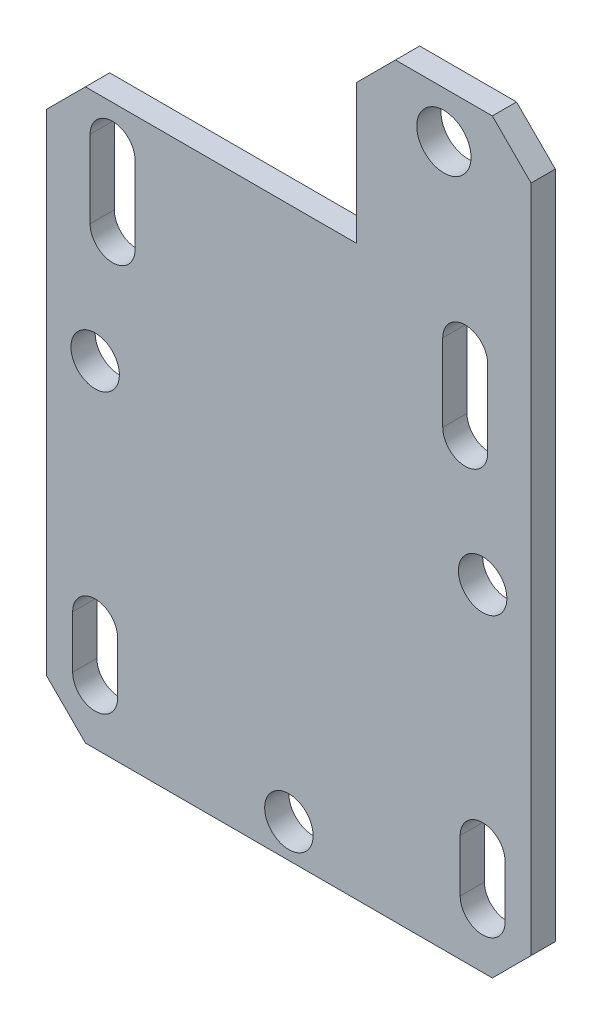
ISO-10303-21;
HEADER;
FILE_DESCRIPTION(('STEP AP214'),'2;1');
FILE_NAME('part.step','',(''),(''),'','','');
FILE_SCHEMA(('AUTOMOTIVE_DESIGN { 1 0 10303 214 1 1 1 1 }'));
ENDSEC;
DATA;
#1=APPLICATION_CONTEXT('core data for automotive mechanical design processes');
#2=APPLICATION_PROTOCOL_DEFINITION('international standard','automotive_design',2000,#1);
#3=PRODUCT_CONTEXT('',#1,'mechanical');
#4=PRODUCT('Part','Part','',(#3));
#5=PRODUCT_RELATED_PRODUCT_CATEGORY('part','',(#4));
#6=PRODUCT_DEFINITION_FORMATION('','',#4);
#7=PRODUCT_DEFINITION_CONTEXT('part definition',#1,'design');
#8=PRODUCT_DEFINITION('design','',#6,#7);
#9=PRODUCT_DEFINITION_SHAPE('','',#8);
#10=(LENGTH_UNIT() NAMED_UNIT(*) SI_UNIT(.MILLI.,.METRE.));
#11=(NAMED_UNIT(*) PLANE_ANGLE_UNIT() SI_UNIT($,.RADIAN.));
#12=(NAMED_UNIT(*) SI_UNIT($,.STERADIAN.) SOLID_ANGLE_UNIT());
#13=UNCERTAINTY_MEASURE_WITH_UNIT(LENGTH_MEASURE(1.E-05),#10,'distance_accuracy_value','');
#14=(GEOMETRIC_REPRESENTATION_CONTEXT(3) GLOBAL_UNCERTAINTY_ASSIGNED_CONTEXT((#13)) GLOBAL_UNIT_ASSIGNED_CONTEXT((#10,
#11,#12)) REPRESENTATION_CONTEXT('',''));
#15=CARTESIAN_POINT('',(0.,0.,0.));
#16=DIRECTION('',(0.,0.,1.));
#17=DIRECTION('',(1.,0.,0.));
#18=AXIS2_PLACEMENT_3D('',#15,#16,#17);
#19=CARTESIAN_POINT('',(0.,-26.1366,1.66726815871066));
#20=DIRECTION('',(0.,0.,1.));
#21=DIRECTION('',(0.,-1.,0.));
#22=AXIS2_PLACEMENT_3D('',#19,#20,#21);
#23=PLANE('',#22);
#24=CARTESIAN_POINT('',(28.575,-15.9766,1.66726815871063));
#25=DIRECTION('',(0.,0.,-1.));
#26=DIRECTION('',(0.,1.,0.));
#27=AXIS2_PLACEMENT_3D('',#24,#25,#26);
#28=CIRCLE('',#27,1.5875);
#29=CARTESIAN_POINT('',(28.575,-14.3891,1.66726815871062));
#30=VERTEX_POINT('',#29);
#31=EDGE_CURVE('E374',#30,#30,#28,.T.);
#32=ORIENTED_EDGE('',*,*,#31,.T.);
#33=EDGE_LOOP('',(#32));
#34=FACE_BOUND('',#33,.T.);
#35=DIRECTION('',(0.,-1.,0.));
#36=VECTOR('',#35,1.);
#37=CARTESIAN_POINT('',(28.9052,-8.3566,1.6672681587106));
#38=LINE('',#37,#36);
#39=CARTESIAN_POINT('',(28.9052,-3.27659999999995,1.66726815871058));
#40=VERTEX_POINT('',#39);
#41=CARTESIAN_POINT('',(28.9052,-8.3566,1.6672681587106));
#42=VERTEX_POINT('',#41);
#43=EDGE_CURVE('E420',#40,#42,#38,.T.);
#44=ORIENTED_EDGE('',*,*,#43,.T.);
#45=CARTESIAN_POINT('',(27.432,-8.35659999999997,1.6672681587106));
#46=DIRECTION('',(0.,0.,-1.));
#47=DIRECTION('',(0.,1.,0.));
#48=AXIS2_PLACEMENT_3D('',#45,#46,#47);
#49=CIRCLE('',#48,1.4732);
#50=CARTESIAN_POINT('',(25.9588,-8.35659999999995,1.6672681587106));
#51=VERTEX_POINT('',#50);
#52=EDGE_CURVE('E411',#42,#51,#49,.T.);
#53=ORIENTED_EDGE('',*,*,#52,.T.);
#54=DIRECTION('',(0.,1.,0.));
#55=VECTOR('',#54,1.);
#56=CARTESIAN_POINT('',(25.9588,-8.35659999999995,1.6672681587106));
#57=LINE('',#56,#55);
#58=CARTESIAN_POINT('',(25.9588,-3.27660000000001,1.66726815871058));
#59=VERTEX_POINT('',#58);
#60=EDGE_CURVE('E414',#51,#59,#57,.T.);
#61=ORIENTED_EDGE('',*,*,#60,.T.);
#62=CARTESIAN_POINT('',(27.432,-3.27659999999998,1.66726815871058));
#63=DIRECTION('',(0.,0.,-1.));
#64=DIRECTION('',(0.,1.,0.));
#65=AXIS2_PLACEMENT_3D('',#62,#63,#64);
#66=CIRCLE('',#65,1.4732);
#67=EDGE_CURVE('E417',#59,#40,#66,.T.);
#68=ORIENTED_EDGE('',*,*,#67,.T.);
#69=EDGE_LOOP('',(#44,#53,#61,#68));
#70=FACE_BOUND('',#69,.T.);
#71=DIRECTION('',(0.,1.,0.));
#72=VECTOR('',#71,1.);
#73=CARTESIAN_POINT('',(2.84480000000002,-8.3566,1.6672681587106));
#74=LINE('',#73,#72);
#75=CARTESIAN_POINT('',(2.84480000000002,-8.3566,1.6672681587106));
#76=VERTEX_POINT('',#75);
#77=CARTESIAN_POINT('',(2.84480000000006,-3.27660000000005,1.66726815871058));
#78=VERTEX_POINT('',#77);
#79=EDGE_CURVE('E389',#76,#78,#74,.T.);
#80=ORIENTED_EDGE('',*,*,#79,.T.);
#81=CARTESIAN_POINT('',(4.31800000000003,-3.2766,1.66726815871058));
#82=DIRECTION('',(0.,0.,-1.));
#83=DIRECTION('',(0.,1.,0.));
#84=AXIS2_PLACEMENT_3D('',#81,#82,#83);
#85=CIRCLE('',#84,1.47319999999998);
#86=CARTESIAN_POINT('',(5.79120000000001,-3.27660000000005,1.66726815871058));
#87=VERTEX_POINT('',#86);
#88=EDGE_CURVE('E380',#78,#87,#85,.T.);
#89=ORIENTED_EDGE('',*,*,#88,.T.);
#90=DIRECTION('',(0.,-1.,0.));
#91=VECTOR('',#90,1.);
#92=CARTESIAN_POINT('',(5.79120000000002,-8.3566,1.6672681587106));
#93=LINE('',#92,#91);
#94=CARTESIAN_POINT('',(5.79120000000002,-8.3566,1.6672681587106));
#95=VERTEX_POINT('',#94);
#96=EDGE_CURVE('E383',#87,#95,#93,.T.);
#97=ORIENTED_EDGE('',*,*,#96,.T.);
#98=CARTESIAN_POINT('',(4.31800000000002,-8.3566,1.6672681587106));
#99=DIRECTION('',(0.,0.,-1.));
#100=DIRECTION('',(0.,1.,0.));
#101=AXIS2_PLACEMENT_3D('',#98,#99,#100);
#102=CIRCLE('',#101,1.4732);
#103=EDGE_CURVE('E386',#95,#76,#102,.T.);
#104=ORIENTED_EDGE('',*,*,#103,.T.);
#105=EDGE_LOOP('',(#80,#89,#97,#104));
#106=FACE_BOUND('',#105,.T.);
#107=CARTESIAN_POINT('',(3.175,-15.9766,1.66726815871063));
#108=DIRECTION('',(0.,0.,-1.));
#109=DIRECTION('',(0.,1.,0.));
#110=AXIS2_PLACEMENT_3D('',#107,#108,#109);
#111=CIRCLE('',#110,1.5875);
#112=CARTESIAN_POINT('',(3.175,-14.3891,1.66726815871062));
#113=VERTEX_POINT('',#112);
#114=EDGE_CURVE('E281',#113,#113,#111,.T.);
#115=ORIENTED_EDGE('',*,*,#114,.T.);
#116=EDGE_LOOP('',(#115));
#117=FACE_BOUND('',#116,.T.);
#118=DIRECTION('',(1.,0.,0.));
#119=VECTOR('',#118,1.);
#120=CARTESIAN_POINT('',(0.,-0.736600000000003,1.66726815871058));
#121=LINE('',#120,#119);
#122=CARTESIAN_POINT('',(2.54000000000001,-0.7366,1.66726815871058));
#123=VERTEX_POINT('',#122);
#124=CARTESIAN_POINT('',(20.32,-0.736600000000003,1.66726815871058));
#125=VERTEX_POINT('',#124);
#126=EDGE_CURVE('E70',#123,#125,#121,.T.);
#127=ORIENTED_EDGE('',*,*,#126,.F.);
#128=DIRECTION('',(0.707106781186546,0.707106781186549,0.));
#129=VECTOR('',#128,1.);
#130=CARTESIAN_POINT('',(-11.43,-14.7066,1.66726815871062));
#131=LINE('',#130,#129);
#132=CARTESIAN_POINT('',(0.,-3.27660000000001,1.66726815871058));
#133=VERTEX_POINT('',#132);
#134=EDGE_CURVE('E456',#123,#133,#131,.F.);
#135=ORIENTED_EDGE('',*,*,#134,.T.);
#136=DIRECTION('',(0.,1.,0.));
#137=VECTOR('',#136,1.);
#138=CARTESIAN_POINT('',(0.,-0.736600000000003,1.66726815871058));
#139=LINE('',#138,#137);
#140=CARTESIAN_POINT('',(0.,-35.4492681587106,1.66726815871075));
#141=VERTEX_POINT('',#140);
#142=EDGE_CURVE('E442',#141,#133,#139,.T.);
#143=ORIENTED_EDGE('',*,*,#142,.F.);
#144=DIRECTION('',(-0.707106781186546,0.707106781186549,0.));
#145=VECTOR('',#144,1.);
#146=CARTESIAN_POINT('',(2.54,-37.9892681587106,1.66726815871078));
#147=LINE('',#146,#145);
#148=CARTESIAN_POINT('',(2.54000000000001,-37.9892681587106,1.66726815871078));
#149=VERTEX_POINT('',#148);
#150=EDGE_CURVE('E282',#141,#149,#147,.F.);
#151=ORIENTED_EDGE('',*,*,#150,.T.);
#152=DIRECTION('',(1.,0.,0.));
#153=VECTOR('',#152,1.);
#154=CARTESIAN_POINT('',(31.75,-37.9892681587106,1.66726815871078));
#155=LINE('',#154,#153);
#156=CARTESIAN_POINT('',(29.21,-37.9892681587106,1.66726815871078));
#157=VERTEX_POINT('',#156);
#158=EDGE_CURVE('E287',#149,#157,#155,.T.);
#159=ORIENTED_EDGE('',*,*,#158,.T.);
#160=DIRECTION('',(-0.707106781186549,-0.707106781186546,0.));
#161=VECTOR('',#160,1.);
#162=CARTESIAN_POINT('',(31.75,-35.4492681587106,1.66726815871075));
#163=LINE('',#162,#161);
#164=CARTESIAN_POINT('',(31.75,-35.4492681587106,1.66726815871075));
#165=VERTEX_POINT('',#164);
#166=EDGE_CURVE('E284',#157,#165,#163,.F.);
#167=ORIENTED_EDGE('',*,*,#166,.T.);
#168=DIRECTION('',(0.,-1.,0.));
#169=VECTOR('',#168,1.);
#170=CARTESIAN_POINT('',(31.75,5.6134,1.66726815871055));
#171=LINE('',#170,#169);
#172=CARTESIAN_POINT('',(31.75,8.4074,1.66726815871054));
#173=VERTEX_POINT('',#172);
#174=EDGE_CURVE('E446',#173,#165,#171,.T.);
#175=ORIENTED_EDGE('',*,*,#174,.F.);
#176=DIRECTION('',(0.707106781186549,-0.707106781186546,0.));
#177=VECTOR('',#176,1.);
#178=CARTESIAN_POINT('',(33.1469999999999,7.01040000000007,1.66726815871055));
#179=LINE('',#178,#177);
#180=CARTESIAN_POINT('',(29.21,10.9474,1.66726815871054));
#181=VERTEX_POINT('',#180);
#182=EDGE_CURVE('E254',#173,#181,#179,.F.);
#183=ORIENTED_EDGE('',*,*,#182,.T.);
#184=DIRECTION('',(1.,0.,0.));
#185=VECTOR('',#184,1.);
#186=CARTESIAN_POINT('',(20.32,10.9474,1.66726815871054));
#187=LINE('',#186,#185);
#188=CARTESIAN_POINT('',(22.86,10.9474,1.66726815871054));
#189=VERTEX_POINT('',#188);
#190=EDGE_CURVE('E249',#189,#181,#187,.T.);
#191=ORIENTED_EDGE('',*,*,#190,.F.);
#192=DIRECTION('',(0.707106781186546,0.707106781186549,0.));
#193=VECTOR('',#192,1.);
#194=CARTESIAN_POINT('',(-7.11199999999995,-19.0246000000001,1.66726815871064));
#195=LINE('',#194,#193);
#196=CARTESIAN_POINT('',(20.32,8.40739999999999,1.66726815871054));
#197=VERTEX_POINT('',#196);
#198=EDGE_CURVE('E246',#189,#197,#195,.F.);
#199=ORIENTED_EDGE('',*,*,#198,.T.);
#200=DIRECTION('',(0.,1.,0.));
#201=VECTOR('',#200,1.);
#202=CARTESIAN_POINT('',(20.32,0.465334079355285,1.66726815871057));
#203=LINE('',#202,#201);
#204=EDGE_CURVE('E234',#125,#197,#203,.T.);
#205=ORIENTED_EDGE('',*,*,#204,.F.);
#206=EDGE_LOOP('',(#127,#135,#143,#151,#159,#167,#175,#183,#191,#199,#205));
#207=FACE_BOUND('',#206,.T.);
#208=DIRECTION('',(0.,1.,0.));
#209=VECTOR('',#208,1.);
#210=CARTESIAN_POINT('',(30.0482,-34.3860363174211,1.66726815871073));
#211=LINE('',#210,#209);
#212=CARTESIAN_POINT('',(30.0482,-34.3860363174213,1.66726815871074));
#213=VERTEX_POINT('',#212);
#214=CARTESIAN_POINT('',(30.0482,-30.957036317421,1.6672681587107));
#215=VERTEX_POINT('',#214);
#216=EDGE_CURVE('E304',#213,#215,#211,.T.);
#217=ORIENTED_EDGE('',*,*,#216,.F.);
#218=CARTESIAN_POINT('',(28.575,-34.3860363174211,1.66726815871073));
#219=DIRECTION('',(0.,0.,1.));
#220=DIRECTION('',(0.,-1.,0.));
#221=AXIS2_PLACEMENT_3D('',#218,#219,#220);
#222=CIRCLE('',#221,1.4732);
#223=CARTESIAN_POINT('',(27.1018,-34.3860363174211,1.66726815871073));
#224=VERTEX_POINT('',#223);
#225=EDGE_CURVE('E298',#224,#213,#222,.T.);
#226=ORIENTED_EDGE('',*,*,#225,.F.);
#227=DIRECTION('',(0.,-1.,0.));
#228=VECTOR('',#227,1.);
#229=CARTESIAN_POINT('',(27.1018,-34.3860363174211,1.66726815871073));
#230=LINE('',#229,#228);
#231=CARTESIAN_POINT('',(27.1018,-30.9570363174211,1.6672681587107));
#232=VERTEX_POINT('',#231);
#233=EDGE_CURVE('E320',#232,#224,#230,.T.);
#234=ORIENTED_EDGE('',*,*,#233,.F.);
#235=CARTESIAN_POINT('',(28.575,-30.957036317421,1.6672681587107));
#236=DIRECTION('',(0.,0.,1.));
#237=DIRECTION('',(0.,-1.,0.));
#238=AXIS2_PLACEMENT_3D('',#235,#236,#237);
#239=CIRCLE('',#238,1.4732);
#240=EDGE_CURVE('E312',#215,#232,#239,.T.);
#241=ORIENTED_EDGE('',*,*,#240,.F.);
#242=EDGE_LOOP('',(#217,#226,#234,#241));
#243=FACE_BOUND('',#242,.T.);
#244=DIRECTION('',(0.,1.,0.));
#245=VECTOR('',#244,1.);
#246=CARTESIAN_POINT('',(4.6482,-34.3860363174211,1.66726815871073));
#247=LINE('',#246,#245);
#248=CARTESIAN_POINT('',(4.6482,-34.3860363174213,1.66726815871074));
#249=VERTEX_POINT('',#248);
#250=CARTESIAN_POINT('',(4.6482,-30.9570363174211,1.6672681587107));
#251=VERTEX_POINT('',#250);
#252=EDGE_CURVE('E333',#249,#251,#247,.T.);
#253=ORIENTED_EDGE('',*,*,#252,.F.);
#254=CARTESIAN_POINT('',(3.175,-34.3860363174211,1.66726815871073));
#255=DIRECTION('',(0.,0.,1.));
#256=DIRECTION('',(0.,-1.,0.));
#257=AXIS2_PLACEMENT_3D('',#254,#255,#256);
#258=CIRCLE('',#257,1.4732);
#259=CARTESIAN_POINT('',(1.7018,-34.3860363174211,1.66726815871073));
#260=VERTEX_POINT('',#259);
#261=EDGE_CURVE('E327',#260,#249,#258,.T.);
#262=ORIENTED_EDGE('',*,*,#261,.F.);
#263=DIRECTION('',(0.,-1.,0.));
#264=VECTOR('',#263,1.);
#265=CARTESIAN_POINT('',(1.7018,-34.3860363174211,1.66726815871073));
#266=LINE('',#265,#264);
#267=CARTESIAN_POINT('',(1.7018,-30.957036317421,1.6672681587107));
#268=VERTEX_POINT('',#267);
#269=EDGE_CURVE('E349',#268,#260,#266,.T.);
#270=ORIENTED_EDGE('',*,*,#269,.F.);
#271=CARTESIAN_POINT('',(3.175,-30.957036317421,1.6672681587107));
#272=DIRECTION('',(0.,0.,1.));
#273=DIRECTION('',(0.,-1.,0.));
#274=AXIS2_PLACEMENT_3D('',#271,#272,#273);
#275=CIRCLE('',#274,1.4732);
#276=EDGE_CURVE('E341',#251,#268,#275,.T.);
#277=ORIENTED_EDGE('',*,*,#276,.F.);
#278=EDGE_LOOP('',(#253,#262,#270,#277));
#279=FACE_BOUND('',#278,.T.);
#280=CARTESIAN_POINT('',(15.875,-35.7830363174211,1.66726815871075));
#281=DIRECTION('',(0.,0.,1.));
#282=DIRECTION('',(0.,-1.,0.));
#283=AXIS2_PLACEMENT_3D('',#280,#281,#282);
#284=CIRCLE('',#283,1.5875);
#285=CARTESIAN_POINT('',(15.875,-37.370536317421,1.66726815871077));
#286=VERTEX_POINT('',#285);
#287=EDGE_CURVE('E356',#286,#286,#284,.T.);
#288=ORIENTED_EDGE('',*,*,#287,.F.);
#289=EDGE_LOOP('',(#288));
#290=FACE_BOUND('',#289,.T.);
#291=CARTESIAN_POINT('',(26.035,7.8994,1.66726815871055));
#292=DIRECTION('',(0.,0.,-1.));
#293=DIRECTION('',(0.,1.,0.));
#294=AXIS2_PLACEMENT_3D('',#291,#292,#293);
#295=CIRCLE('',#294,1.778);
#296=CARTESIAN_POINT('',(26.035,9.6774,1.66726815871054));
#297=VERTEX_POINT('',#296);
#298=EDGE_CURVE('E253',#297,#297,#295,.T.);
#299=ORIENTED_EDGE('',*,*,#298,.T.);
#300=EDGE_LOOP('',(#299));
#301=FACE_BOUND('',#300,.T.);
#302=ADVANCED_FACE('F55',(#34,#70,#106,#117,#207,#243,#279,#290,#301),#23,.T.);
#303=CARTESIAN_POINT('',(0.,-26.1366,0.0797681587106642));
#304=DIRECTION('',(0.,0.,1.));
#305=DIRECTION('',(0.,-1.,0.));
#306=AXIS2_PLACEMENT_3D('',#303,#304,#305);
#307=PLANE('',#306);
#308=CARTESIAN_POINT('',(3.175,-15.9766,0.0797681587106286));
#309=DIRECTION('',(0.,0.,-1.));
#310=DIRECTION('',(0.,1.,0.));
#311=AXIS2_PLACEMENT_3D('',#308,#309,#310);
#312=CIRCLE('',#311,1.5875);
#313=CARTESIAN_POINT('',(3.175,-14.3891,0.0797681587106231));
#314=VERTEX_POINT('',#313);
#315=EDGE_CURVE('E371',#314,#314,#312,.T.);
#316=ORIENTED_EDGE('',*,*,#315,.F.);
#317=EDGE_LOOP('',(#316));
#318=FACE_BOUND('',#317,.T.);
#319=CARTESIAN_POINT('',(4.31800000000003,-3.2766,0.0797681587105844));
#320=DIRECTION('',(0.,0.,-1.));
#321=DIRECTION('',(0.,1.,0.));
#322=AXIS2_PLACEMENT_3D('',#319,#320,#321);
#323=CIRCLE('',#322,1.47319999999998);
#324=CARTESIAN_POINT('',(2.84480000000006,-3.27660000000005,0.0797681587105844));
#325=VERTEX_POINT('',#324);
#326=CARTESIAN_POINT('',(5.79120000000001,-3.27660000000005,0.0797681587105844));
#327=VERTEX_POINT('',#326);
#328=EDGE_CURVE('E392',#325,#327,#323,.T.);
#329=ORIENTED_EDGE('',*,*,#328,.F.);
#330=DIRECTION('',(0.,1.,0.));
#331=VECTOR('',#330,1.);
#332=CARTESIAN_POINT('',(2.84480000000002,-8.35660000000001,0.0797681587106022));
#333=LINE('',#332,#331);
#334=CARTESIAN_POINT('',(2.84480000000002,-8.35660000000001,0.0797681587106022));
#335=VERTEX_POINT('',#334);
#336=EDGE_CURVE('E399',#335,#325,#333,.T.);
#337=ORIENTED_EDGE('',*,*,#336,.F.);
#338=CARTESIAN_POINT('',(4.31800000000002,-8.35660000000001,0.0797681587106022));
#339=DIRECTION('',(0.,0.,-1.));
#340=DIRECTION('',(0.,1.,0.));
#341=AXIS2_PLACEMENT_3D('',#338,#339,#340);
#342=CIRCLE('',#341,1.4732);
#343=CARTESIAN_POINT('',(5.79120000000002,-8.35660000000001,0.0797681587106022));
#344=VERTEX_POINT('',#343);
#345=EDGE_CURVE('E396',#344,#335,#342,.T.);
#346=ORIENTED_EDGE('',*,*,#345,.F.);
#347=DIRECTION('',(0.,-1.,0.));
#348=VECTOR('',#347,1.);
#349=CARTESIAN_POINT('',(5.79120000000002,-8.35660000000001,0.0797681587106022));
#350=LINE('',#349,#348);
#351=EDGE_CURVE('E394',#327,#344,#350,.T.);
#352=ORIENTED_EDGE('',*,*,#351,.F.);
#353=EDGE_LOOP('',(#329,#337,#346,#352));
#354=FACE_BOUND('',#353,.T.);
#355=CARTESIAN_POINT('',(27.432,-8.35659999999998,0.0797681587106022));
#356=DIRECTION('',(0.,0.,-1.));
#357=DIRECTION('',(0.,1.,0.));
#358=AXIS2_PLACEMENT_3D('',#355,#356,#357);
#359=CIRCLE('',#358,1.4732);
#360=CARTESIAN_POINT('',(28.9052,-8.35660000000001,0.0797681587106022));
#361=VERTEX_POINT('',#360);
#362=CARTESIAN_POINT('',(25.9588,-8.35659999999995,0.0797681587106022));
#363=VERTEX_POINT('',#362);
#364=EDGE_CURVE('E423',#361,#363,#359,.T.);
#365=ORIENTED_EDGE('',*,*,#364,.F.);
#366=DIRECTION('',(0.,-1.,0.));
#367=VECTOR('',#366,1.);
#368=CARTESIAN_POINT('',(28.9052,-8.35660000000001,0.0797681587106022));
#369=LINE('',#368,#367);
#370=CARTESIAN_POINT('',(28.9052,-3.27659999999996,0.0797681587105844));
#371=VERTEX_POINT('',#370);
#372=EDGE_CURVE('E430',#371,#361,#369,.T.);
#373=ORIENTED_EDGE('',*,*,#372,.F.);
#374=CARTESIAN_POINT('',(27.432,-3.27659999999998,0.0797681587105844));
#375=DIRECTION('',(0.,0.,-1.));
#376=DIRECTION('',(0.,1.,0.));
#377=AXIS2_PLACEMENT_3D('',#374,#375,#376);
#378=CIRCLE('',#377,1.4732);
#379=CARTESIAN_POINT('',(25.9588,-3.27660000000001,0.0797681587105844));
#380=VERTEX_POINT('',#379);
#381=EDGE_CURVE('E427',#380,#371,#378,.T.);
#382=ORIENTED_EDGE('',*,*,#381,.F.);
#383=DIRECTION('',(0.,1.,0.));
#384=VECTOR('',#383,1.);
#385=CARTESIAN_POINT('',(25.9588,-8.35659999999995,0.0797681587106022));
#386=LINE('',#385,#384);
#387=EDGE_CURVE('E425',#363,#380,#386,.T.);
#388=ORIENTED_EDGE('',*,*,#387,.F.);
#389=EDGE_LOOP('',(#365,#373,#382,#388));
#390=FACE_BOUND('',#389,.T.);
#391=CARTESIAN_POINT('',(28.575,-15.9766,0.0797681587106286));
#392=DIRECTION('',(0.,0.,-1.));
#393=DIRECTION('',(0.,1.,0.));
#394=AXIS2_PLACEMENT_3D('',#391,#392,#393);
#395=CIRCLE('',#394,1.5875);
#396=CARTESIAN_POINT('',(28.575,-14.3891,0.0797681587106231));
#397=VERTEX_POINT('',#396);
#398=EDGE_CURVE('E377',#397,#397,#395,.T.);
#399=ORIENTED_EDGE('',*,*,#398,.F.);
#400=EDGE_LOOP('',(#399));
#401=FACE_BOUND('',#400,.T.);
#402=DIRECTION('',(0.,1.,0.));
#403=VECTOR('',#402,1.);
#404=CARTESIAN_POINT('',(0.,-0.736600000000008,0.0797681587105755));
#405=LINE('',#404,#403);
#406=CARTESIAN_POINT('',(0.,-35.4492681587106,0.0797681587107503));
#407=VERTEX_POINT('',#406);
#408=CARTESIAN_POINT('',(0.,-3.27660000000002,0.0797681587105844));
#409=VERTEX_POINT('',#408);
#410=EDGE_CURVE('E447',#407,#409,#405,.T.);
#411=ORIENTED_EDGE('',*,*,#410,.T.);
#412=DIRECTION('',(-0.707106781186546,-0.707106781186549,0.));
#413=VECTOR('',#412,1.);
#414=CARTESIAN_POINT('',(2.54,-0.736600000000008,0.0797681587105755));
#415=LINE('',#414,#413);
#416=CARTESIAN_POINT('',(2.54,-0.736600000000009,0.0797681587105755));
#417=VERTEX_POINT('',#416);
#418=EDGE_CURVE('E63',#409,#417,#415,.F.);
#419=ORIENTED_EDGE('',*,*,#418,.T.);
#420=DIRECTION('',(1.,0.,0.));
#421=VECTOR('',#420,1.);
#422=CARTESIAN_POINT('',(0.,-0.736600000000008,0.0797681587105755));
#423=LINE('',#422,#421);
#424=CARTESIAN_POINT('',(20.32,-0.736600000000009,0.0797681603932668));
#425=VERTEX_POINT('',#424);
#426=EDGE_CURVE('E77',#417,#425,#423,.T.);
#427=ORIENTED_EDGE('',*,*,#426,.T.);
#428=DIRECTION('',(0.,1.,0.));
#429=VECTOR('',#428,1.);
#430=CARTESIAN_POINT('',(20.32,-0.736600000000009,0.0797681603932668));
#431=LINE('',#430,#429);
#432=CARTESIAN_POINT('',(20.32,8.40739999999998,0.0797681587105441));
#433=VERTEX_POINT('',#432);
#434=EDGE_CURVE('E242',#425,#433,#431,.T.);
#435=ORIENTED_EDGE('',*,*,#434,.T.);
#436=DIRECTION('',(-0.707106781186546,-0.707106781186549,0.));
#437=VECTOR('',#436,1.);
#438=CARTESIAN_POINT('',(22.86,10.9474,0.0797681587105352));
#439=LINE('',#438,#437);
#440=CARTESIAN_POINT('',(22.86,10.9474,0.0797681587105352));
#441=VERTEX_POINT('',#440);
#442=EDGE_CURVE('E257',#433,#441,#439,.F.);
#443=ORIENTED_EDGE('',*,*,#442,.T.);
#444=DIRECTION('',(1.,0.,0.));
#445=VECTOR('',#444,1.);
#446=CARTESIAN_POINT('',(20.32,10.9474,0.0797681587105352));
#447=LINE('',#446,#445);
#448=CARTESIAN_POINT('',(29.21,10.9474,0.0797681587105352));
#449=VERTEX_POINT('',#448);
#450=EDGE_CURVE('E262',#441,#449,#447,.T.);
#451=ORIENTED_EDGE('',*,*,#450,.T.);
#452=DIRECTION('',(-0.707106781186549,0.707106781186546,0.));
#453=VECTOR('',#452,1.);
#454=CARTESIAN_POINT('',(31.75,8.40739999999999,0.0797681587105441));
#455=LINE('',#454,#453);
#456=CARTESIAN_POINT('',(31.75,8.40739999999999,0.0797681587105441));
#457=VERTEX_POINT('',#456);
#458=EDGE_CURVE('E258',#449,#457,#455,.F.);
#459=ORIENTED_EDGE('',*,*,#458,.T.);
#460=DIRECTION('',(0.,-1.,0.));
#461=VECTOR('',#460,1.);
#462=CARTESIAN_POINT('',(31.75,5.61339999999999,0.0797681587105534));
#463=LINE('',#462,#461);
#464=CARTESIAN_POINT('',(31.75,-35.4492681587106,0.0797681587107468));
#465=VERTEX_POINT('',#464);
#466=EDGE_CURVE('E451',#457,#465,#463,.T.);
#467=ORIENTED_EDGE('',*,*,#466,.T.);
#468=DIRECTION('',(0.707106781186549,0.707106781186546,0.));
#469=VECTOR('',#468,1.);
#470=CARTESIAN_POINT('',(30.48,-36.7192681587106,0.0797681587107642));
#471=LINE('',#470,#469);
#472=CARTESIAN_POINT('',(29.21,-37.9892681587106,0.0797681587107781));
#473=VERTEX_POINT('',#472);
#474=EDGE_CURVE('E296',#465,#473,#471,.F.);
#475=ORIENTED_EDGE('',*,*,#474,.T.);
#476=DIRECTION('',(1.,0.,0.));
#477=VECTOR('',#476,1.);
#478=CARTESIAN_POINT('',(31.75,-37.9892681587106,0.0797681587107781));
#479=LINE('',#478,#477);
#480=CARTESIAN_POINT('',(2.54,-37.9892681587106,0.0797681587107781));
#481=VERTEX_POINT('',#480);
#482=EDGE_CURVE('E277',#481,#473,#479,.T.);
#483=ORIENTED_EDGE('',*,*,#482,.F.);
#484=DIRECTION('',(0.707106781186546,-0.707106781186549,0.));
#485=VECTOR('',#484,1.);
#486=CARTESIAN_POINT('',(17.145,-52.5942681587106,0.0797681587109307));
#487=LINE('',#486,#485);
#488=EDGE_CURVE('E293',#481,#407,#487,.F.);
#489=ORIENTED_EDGE('',*,*,#488,.T.);
#490=EDGE_LOOP('',(#411,#419,#427,#435,#443,#451,#459,#467,#475,#483,#489));
#491=FACE_BOUND('',#490,.T.);
#492=CARTESIAN_POINT('',(28.575,-34.3860363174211,0.0797681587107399));
#493=DIRECTION('',(0.,0.,-1.));
#494=DIRECTION('',(0.,1.,0.));
#495=AXIS2_PLACEMENT_3D('',#492,#493,#494);
#496=CIRCLE('',#495,1.4732);
#497=CARTESIAN_POINT('',(30.0482,-34.3860363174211,0.0797681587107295));
#498=VERTEX_POINT('',#497);
#499=CARTESIAN_POINT('',(27.1018,-34.3860363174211,0.0797681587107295));
#500=VERTEX_POINT('',#499);
#501=EDGE_CURVE('E302',#498,#500,#496,.T.);
#502=ORIENTED_EDGE('',*,*,#501,.F.);
#503=DIRECTION('',(0.,-1.,0.));
#504=VECTOR('',#503,1.);
#505=CARTESIAN_POINT('',(30.0482,-37.9892681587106,0.0797681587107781));
#506=LINE('',#505,#504);
#507=CARTESIAN_POINT('',(30.0482,-30.957036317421,0.0797681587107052));
#508=VERTEX_POINT('',#507);
#509=EDGE_CURVE('E310',#508,#498,#506,.T.);
#510=ORIENTED_EDGE('',*,*,#509,.F.);
#511=CARTESIAN_POINT('',(28.575,-30.9570363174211,0.0797681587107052));
#512=DIRECTION('',(0.,0.,-1.));
#513=DIRECTION('',(0.,1.,0.));
#514=AXIS2_PLACEMENT_3D('',#511,#512,#513);
#515=CIRCLE('',#514,1.4732);
#516=CARTESIAN_POINT('',(27.1018,-30.9570363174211,0.0797681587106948));
#517=VERTEX_POINT('',#516);
#518=EDGE_CURVE('E317',#517,#508,#515,.T.);
#519=ORIENTED_EDGE('',*,*,#518,.F.);
#520=DIRECTION('',(0.,1.,0.));
#521=VECTOR('',#520,1.);
#522=CARTESIAN_POINT('',(27.1018,-37.9892681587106,0.0797681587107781));
#523=LINE('',#522,#521);
#524=EDGE_CURVE('E325',#500,#517,#523,.T.);
#525=ORIENTED_EDGE('',*,*,#524,.F.);
#526=EDGE_LOOP('',(#502,#510,#519,#525));
#527=FACE_BOUND('',#526,.T.);
#528=CARTESIAN_POINT('',(3.175,-34.3860363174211,0.0797681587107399));
#529=DIRECTION('',(0.,0.,-1.));
#530=DIRECTION('',(0.,1.,0.));
#531=AXIS2_PLACEMENT_3D('',#528,#529,#530);
#532=CIRCLE('',#531,1.4732);
#533=CARTESIAN_POINT('',(4.6482,-34.3860363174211,0.0797681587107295));
#534=VERTEX_POINT('',#533);
#535=CARTESIAN_POINT('',(1.7018,-34.3860363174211,0.0797681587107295));
#536=VERTEX_POINT('',#535);
#537=EDGE_CURVE('E331',#534,#536,#532,.T.);
#538=ORIENTED_EDGE('',*,*,#537,.F.);
#539=DIRECTION('',(0.,-1.,0.));
#540=VECTOR('',#539,1.);
#541=CARTESIAN_POINT('',(4.6482,-37.9892681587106,0.0797681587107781));
#542=LINE('',#541,#540);
#543=CARTESIAN_POINT('',(4.6482,-30.9570363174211,0.0797681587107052));
#544=VERTEX_POINT('',#543);
#545=EDGE_CURVE('E339',#544,#534,#542,.T.);
#546=ORIENTED_EDGE('',*,*,#545,.F.);
#547=CARTESIAN_POINT('',(3.175,-30.9570363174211,0.0797681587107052));
#548=DIRECTION('',(0.,0.,-1.));
#549=DIRECTION('',(0.,1.,0.));
#550=AXIS2_PLACEMENT_3D('',#547,#548,#549);
#551=CIRCLE('',#550,1.4732);
#552=CARTESIAN_POINT('',(1.7018,-30.957036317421,0.0797681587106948));
#553=VERTEX_POINT('',#552);
#554=EDGE_CURVE('E346',#553,#544,#551,.T.);
#555=ORIENTED_EDGE('',*,*,#554,.F.);
#556=DIRECTION('',(0.,1.,0.));
#557=VECTOR('',#556,1.);
#558=CARTESIAN_POINT('',(1.7018,-37.9892681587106,0.0797681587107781));
#559=LINE('',#558,#557);
#560=EDGE_CURVE('E354',#536,#553,#559,.T.);
#561=ORIENTED_EDGE('',*,*,#560,.F.);
#562=EDGE_LOOP('',(#538,#546,#555,#561));
#563=FACE_BOUND('',#562,.T.);
#564=CARTESIAN_POINT('',(15.875,-35.7830363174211,0.0797681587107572));
#565=DIRECTION('',(0.,0.,-1.));
#566=DIRECTION('',(0.,1.,0.));
#567=AXIS2_PLACEMENT_3D('',#564,#565,#566);
#568=CIRCLE('',#567,1.5875);
#569=CARTESIAN_POINT('',(15.875,-34.1955363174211,0.0797681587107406));
#570=VERTEX_POINT('',#569);
#571=EDGE_CURVE('E359',#570,#570,#568,.T.);
#572=ORIENTED_EDGE('',*,*,#571,.F.);
#573=EDGE_LOOP('',(#572));
#574=FACE_BOUND('',#573,.T.);
#575=CARTESIAN_POINT('',(26.035,7.89939999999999,0.0797681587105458));
#576=DIRECTION('',(0.,0.,-1.));
#577=DIRECTION('',(0.,1.,0.));
#578=AXIS2_PLACEMENT_3D('',#575,#576,#577);
#579=CIRCLE('',#578,1.778);
#580=CARTESIAN_POINT('',(26.035,9.67739999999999,0.0797681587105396));
#581=VERTEX_POINT('',#580);
#582=EDGE_CURVE('E267',#581,#581,#579,.T.);
#583=ORIENTED_EDGE('',*,*,#582,.F.);
#584=EDGE_LOOP('',(#583));
#585=FACE_BOUND('',#584,.T.);
#586=ADVANCED_FACE('F57',(#318,#354,#390,#401,#491,#527,#563,#574,#585),#307,.F.);
#587=CARTESIAN_POINT('',(0.,-0.736600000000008,0.0797681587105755));
#588=DIRECTION('',(1.,0.,0.));
#589=DIRECTION('',(0.,-1.,0.));
#590=AXIS2_PLACEMENT_3D('',#587,#588,#589);
#591=PLANE('',#590);
#592=ORIENTED_EDGE('',*,*,#142,.T.);
#593=DIRECTION('',(0.,0.,-1.));
#594=VECTOR('',#593,1.);
#595=CARTESIAN_POINT('',(0.,-3.27660000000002,0.0797681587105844));
#596=LINE('',#595,#594);
#597=EDGE_CURVE('E458',#133,#409,#596,.T.);
#598=ORIENTED_EDGE('',*,*,#597,.T.);
#599=ORIENTED_EDGE('',*,*,#410,.F.);
#600=DIRECTION('',(0.,0.,1.));
#601=VECTOR('',#600,1.);
#602=CARTESIAN_POINT('',(0.,-35.4492681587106,1.66726815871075));
#603=LINE('',#602,#601);
#604=EDGE_CURVE('E278',#407,#141,#603,.T.);
#605=ORIENTED_EDGE('',*,*,#604,.T.);
#606=EDGE_LOOP('',(#592,#598,#599,#605));
#607=FACE_BOUND('',#606,.T.);
#608=ADVANCED_FACE('F467',(#607),#591,.F.);
#609=CARTESIAN_POINT('',(31.75,5.61339999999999,0.0797681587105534));
#610=DIRECTION('',(-1.,0.,0.));
#611=DIRECTION('',(0.,1.,0.));
#612=AXIS2_PLACEMENT_3D('',#609,#610,#611);
#613=PLANE('',#612);
#614=ORIENTED_EDGE('',*,*,#174,.T.);
#615=DIRECTION('',(0.,0.,-1.));
#616=VECTOR('',#615,1.);
#617=CARTESIAN_POINT('',(31.75,-35.4492681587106,1.66726815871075));
#618=LINE('',#617,#616);
#619=EDGE_CURVE('E290',#165,#465,#618,.T.);
#620=ORIENTED_EDGE('',*,*,#619,.T.);
#621=ORIENTED_EDGE('',*,*,#466,.F.);
#622=DIRECTION('',(0.,0.,1.));
#623=VECTOR('',#622,1.);
#624=CARTESIAN_POINT('',(31.75,8.40739999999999,0.0797681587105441));
#625=LINE('',#624,#623);
#626=EDGE_CURVE('E243',#457,#173,#625,.T.);
#627=ORIENTED_EDGE('',*,*,#626,.T.);
#628=EDGE_LOOP('',(#614,#620,#621,#627));
#629=FACE_BOUND('',#628,.T.);
#630=ADVANCED_FACE('F491',(#629),#613,.F.);
#631=CARTESIAN_POINT('',(0.,-0.736600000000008,0.0797681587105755));
#632=DIRECTION('',(0.,-1.,0.));
#633=DIRECTION('',(-1.,0.,0.));
#634=AXIS2_PLACEMENT_3D('',#631,#632,#633);
#635=PLANE('',#634);
#636=ORIENTED_EDGE('',*,*,#426,.F.);
#637=DIRECTION('',(0.,0.,1.));
#638=VECTOR('',#637,1.);
#639=CARTESIAN_POINT('',(2.54,-0.736600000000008,0.0797681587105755));
#640=LINE('',#639,#638);
#641=EDGE_CURVE('E454',#417,#123,#640,.T.);
#642=ORIENTED_EDGE('',*,*,#641,.T.);
#643=ORIENTED_EDGE('',*,*,#126,.T.);
#644=DIRECTION('',(0.,0.,1.));
#645=VECTOR('',#644,1.);
#646=CARTESIAN_POINT('',(20.32,-0.736600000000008,0.0797681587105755));
#647=LINE('',#646,#645);
#648=EDGE_CURVE('E12',#425,#125,#647,.T.);
#649=ORIENTED_EDGE('',*,*,#648,.F.);
#650=EDGE_LOOP('',(#636,#642,#643,#649));
#651=FACE_BOUND('',#650,.T.);
#652=ADVANCED_FACE('F464',(#651),#635,.F.);
#653=CARTESIAN_POINT('',(27.432,-8.35659999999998,0.0797681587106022));
#654=DIRECTION('',(0.,0.,1.));
#655=DIRECTION('',(0.,-1.,0.));
#656=AXIS2_PLACEMENT_3D('',#653,#654,#655);
#657=CYLINDRICAL_SURFACE('',#656,1.4732);
#658=ORIENTED_EDGE('',*,*,#52,.F.);
#659=DIRECTION('',(0.,0.,1.));
#660=VECTOR('',#659,1.);
#661=CARTESIAN_POINT('',(28.9052,-8.35660000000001,0.0797681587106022));
#662=LINE('',#661,#660);
#663=EDGE_CURVE('E432',#361,#42,#662,.T.);
#664=ORIENTED_EDGE('',*,*,#663,.F.);
#665=ORIENTED_EDGE('',*,*,#364,.T.);
#666=DIRECTION('',(0.,0.,1.));
#667=VECTOR('',#666,1.);
#668=CARTESIAN_POINT('',(25.9588,-8.35659999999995,0.0797681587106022));
#669=LINE('',#668,#667);
#670=EDGE_CURVE('E439',#363,#51,#669,.T.);
#671=ORIENTED_EDGE('',*,*,#670,.T.);
#672=EDGE_LOOP('',(#658,#664,#665,#671));
#673=FACE_BOUND('',#672,.T.);
#674=ADVANCED_FACE('F523',(#673),#657,.F.);
#675=CARTESIAN_POINT('',(25.9588,-8.35659999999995,0.0797681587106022));
#676=DIRECTION('',(1.,0.,0.));
#677=DIRECTION('',(0.,-1.,0.));
#678=AXIS2_PLACEMENT_3D('',#675,#676,#677);
#679=PLANE('',#678);
#680=ORIENTED_EDGE('',*,*,#60,.F.);
#681=ORIENTED_EDGE('',*,*,#670,.F.);
#682=ORIENTED_EDGE('',*,*,#387,.T.);
#683=DIRECTION('',(0.,0.,1.));
#684=VECTOR('',#683,1.);
#685=CARTESIAN_POINT('',(25.9588,-3.27660000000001,0.0797681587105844));
#686=LINE('',#685,#684);
#687=EDGE_CURVE('E437',#380,#59,#686,.T.);
#688=ORIENTED_EDGE('',*,*,#687,.T.);
#689=EDGE_LOOP('',(#680,#681,#682,#688));
#690=FACE_BOUND('',#689,.T.);
#691=ADVANCED_FACE('F787',(#690),#679,.T.);
#692=CARTESIAN_POINT('',(27.432,-3.27659999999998,0.0797681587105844));
#693=DIRECTION('',(0.,0.,1.));
#694=DIRECTION('',(0.,-1.,0.));
#695=AXIS2_PLACEMENT_3D('',#692,#693,#694);
#696=CYLINDRICAL_SURFACE('',#695,1.4732);
#697=ORIENTED_EDGE('',*,*,#67,.F.);
#698=ORIENTED_EDGE('',*,*,#687,.F.);
#699=ORIENTED_EDGE('',*,*,#381,.T.);
#700=DIRECTION('',(0.,0.,1.));
#701=VECTOR('',#700,1.);
#702=CARTESIAN_POINT('',(28.9052,-3.27659999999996,0.0797681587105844));
#703=LINE('',#702,#701);
#704=EDGE_CURVE('E435',#371,#40,#703,.T.);
#705=ORIENTED_EDGE('',*,*,#704,.T.);
#706=EDGE_LOOP('',(#697,#698,#699,#705));
#707=FACE_BOUND('',#706,.T.);
#708=ADVANCED_FACE('F779',(#707),#696,.F.);
#709=CARTESIAN_POINT('',(28.9052,-8.35660000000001,0.0797681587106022));
#710=DIRECTION('',(-1.,0.,0.));
#711=DIRECTION('',(0.,1.,0.));
#712=AXIS2_PLACEMENT_3D('',#709,#710,#711);
#713=PLANE('',#712);
#714=ORIENTED_EDGE('',*,*,#43,.F.);
#715=ORIENTED_EDGE('',*,*,#704,.F.);
#716=ORIENTED_EDGE('',*,*,#372,.T.);
#717=ORIENTED_EDGE('',*,*,#663,.T.);
#718=EDGE_LOOP('',(#714,#715,#716,#717));
#719=FACE_BOUND('',#718,.T.);
#720=ADVANCED_FACE('F771',(#719),#713,.T.);
#721=CARTESIAN_POINT('',(4.31800000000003,-3.2766,0.0797681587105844));
#722=DIRECTION('',(0.,0.,1.));
#723=DIRECTION('',(0.,-1.,0.));
#724=AXIS2_PLACEMENT_3D('',#721,#722,#723);
#725=CYLINDRICAL_SURFACE('',#724,1.47319999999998);
#726=ORIENTED_EDGE('',*,*,#88,.F.);
#727=DIRECTION('',(0.,0.,1.));
#728=VECTOR('',#727,1.);
#729=CARTESIAN_POINT('',(2.84480000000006,-3.27660000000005,0.0797681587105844));
#730=LINE('',#729,#728);
#731=EDGE_CURVE('E401',#325,#78,#730,.T.);
#732=ORIENTED_EDGE('',*,*,#731,.F.);
#733=ORIENTED_EDGE('',*,*,#328,.T.);
#734=DIRECTION('',(0.,0.,1.));
#735=VECTOR('',#734,1.);
#736=CARTESIAN_POINT('',(5.79120000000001,-3.27660000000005,0.0797681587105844));
#737=LINE('',#736,#735);
#738=EDGE_CURVE('E408',#327,#87,#737,.T.);
#739=ORIENTED_EDGE('',*,*,#738,.T.);
#740=EDGE_LOOP('',(#726,#732,#733,#739));
#741=FACE_BOUND('',#740,.T.);
#742=ADVANCED_FACE('F763',(#741),#725,.F.);
#743=CARTESIAN_POINT('',(5.79120000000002,-8.35660000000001,0.0797681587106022));
#744=DIRECTION('',(-1.,0.,0.));
#745=DIRECTION('',(0.,1.,0.));
#746=AXIS2_PLACEMENT_3D('',#743,#744,#745);
#747=PLANE('',#746);
#748=ORIENTED_EDGE('',*,*,#96,.F.);
#749=ORIENTED_EDGE('',*,*,#738,.F.);
#750=ORIENTED_EDGE('',*,*,#351,.T.);
#751=DIRECTION('',(0.,0.,1.));
#752=VECTOR('',#751,1.);
#753=CARTESIAN_POINT('',(5.79120000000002,-8.35660000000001,0.0797681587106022));
#754=LINE('',#753,#752);
#755=EDGE_CURVE('E406',#344,#95,#754,.T.);
#756=ORIENTED_EDGE('',*,*,#755,.T.);
#757=EDGE_LOOP('',(#748,#749,#750,#756));
#758=FACE_BOUND('',#757,.T.);
#759=ADVANCED_FACE('F755',(#758),#747,.T.);
#760=CARTESIAN_POINT('',(4.31800000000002,-8.35660000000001,0.0797681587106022));
#761=DIRECTION('',(0.,0.,1.));
#762=DIRECTION('',(0.,-1.,0.));
#763=AXIS2_PLACEMENT_3D('',#760,#761,#762);
#764=CYLINDRICAL_SURFACE('',#763,1.4732);
#765=ORIENTED_EDGE('',*,*,#103,.F.);
#766=ORIENTED_EDGE('',*,*,#755,.F.);
#767=ORIENTED_EDGE('',*,*,#345,.T.);
#768=DIRECTION('',(0.,0.,1.));
#769=VECTOR('',#768,1.);
#770=CARTESIAN_POINT('',(2.84480000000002,-8.35660000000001,0.0797681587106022));
#771=LINE('',#770,#769);
#772=EDGE_CURVE('E404',#335,#76,#771,.T.);
#773=ORIENTED_EDGE('',*,*,#772,.T.);
#774=EDGE_LOOP('',(#765,#766,#767,#773));
#775=FACE_BOUND('',#774,.T.);
#776=ADVANCED_FACE('F747',(#775),#764,.F.);
#777=CARTESIAN_POINT('',(2.84480000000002,-8.35660000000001,0.0797681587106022));
#778=DIRECTION('',(1.,0.,0.));
#779=DIRECTION('',(0.,-1.,0.));
#780=AXIS2_PLACEMENT_3D('',#777,#778,#779);
#781=PLANE('',#780);
#782=ORIENTED_EDGE('',*,*,#79,.F.);
#783=ORIENTED_EDGE('',*,*,#772,.F.);
#784=ORIENTED_EDGE('',*,*,#336,.T.);
#785=ORIENTED_EDGE('',*,*,#731,.T.);
#786=EDGE_LOOP('',(#782,#783,#784,#785));
#787=FACE_BOUND('',#786,.T.);
#788=ADVANCED_FACE('F739',(#787),#781,.T.);
#789=CARTESIAN_POINT('',(28.575,-15.9766,0.0797681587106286));
#790=DIRECTION('',(0.,0.,1.));
#791=DIRECTION('',(0.,-1.,0.));
#792=AXIS2_PLACEMENT_3D('',#789,#790,#791);
#793=CYLINDRICAL_SURFACE('',#792,1.5875);
#794=ORIENTED_EDGE('',*,*,#398,.T.);
#795=EDGE_LOOP('',(#794));
#796=FACE_BOUND('',#795,.T.);
#797=ORIENTED_EDGE('',*,*,#31,.F.);
#798=EDGE_LOOP('',(#797));
#799=FACE_BOUND('',#798,.T.);
#800=ADVANCED_FACE('F731',(#796,#799),#793,.F.);
#801=CARTESIAN_POINT('',(3.175,-15.9766,0.0797681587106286));
#802=DIRECTION('',(0.,0.,1.));
#803=DIRECTION('',(0.,-1.,0.));
#804=AXIS2_PLACEMENT_3D('',#801,#802,#803);
#805=CYLINDRICAL_SURFACE('',#804,1.5875);
#806=ORIENTED_EDGE('',*,*,#315,.T.);
#807=EDGE_LOOP('',(#806));
#808=FACE_BOUND('',#807,.T.);
#809=ORIENTED_EDGE('',*,*,#114,.F.);
#810=EDGE_LOOP('',(#809));
#811=FACE_BOUND('',#810,.T.);
#812=ADVANCED_FACE('F724',(#808,#811),#805,.F.);
#813=CARTESIAN_POINT('',(2.54,-0.736600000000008,0.0797681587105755));
#814=DIRECTION('',(0.707106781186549,-0.707106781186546,0.));
#815=DIRECTION('',(0.707106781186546,0.707106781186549,0.));
#816=AXIS2_PLACEMENT_3D('',#813,#814,#815);
#817=PLANE('',#816);
#818=ORIENTED_EDGE('',*,*,#418,.F.);
#819=ORIENTED_EDGE('',*,*,#597,.F.);
#820=ORIENTED_EDGE('',*,*,#134,.F.);
#821=ORIENTED_EDGE('',*,*,#641,.F.);
#822=EDGE_LOOP('',(#818,#819,#820,#821));
#823=FACE_BOUND('',#822,.T.);
#824=ADVANCED_FACE('F465',(#823),#817,.F.);
#825=CARTESIAN_POINT('',(2.54,-37.9892681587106,1.66726815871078));
#826=DIRECTION('',(0.707106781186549,0.707106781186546,0.));
#827=DIRECTION('',(0.707106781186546,-0.707106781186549,0.));
#828=AXIS2_PLACEMENT_3D('',#825,#826,#827);
#829=PLANE('',#828);
#830=ORIENTED_EDGE('',*,*,#150,.F.);
#831=ORIENTED_EDGE('',*,*,#604,.F.);
#832=ORIENTED_EDGE('',*,*,#488,.F.);
#833=DIRECTION('',(0.,0.,-1.));
#834=VECTOR('',#833,1.);
#835=CARTESIAN_POINT('',(2.54,-37.9892681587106,1.66726815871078));
#836=LINE('',#835,#834);
#837=EDGE_CURVE('E362',#149,#481,#836,.T.);
#838=ORIENTED_EDGE('',*,*,#837,.F.);
#839=EDGE_LOOP('',(#830,#831,#832,#838));
#840=FACE_BOUND('',#839,.T.);
#841=ADVANCED_FACE('F472',(#840),#829,.F.);
#842=CARTESIAN_POINT('',(31.75,-37.9892681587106,1.66726815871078));
#843=DIRECTION('',(0.,1.,0.));
#844=DIRECTION('',(0.,0.,1.));
#845=AXIS2_PLACEMENT_3D('',#842,#843,#844);
#846=PLANE('',#845);
#847=ORIENTED_EDGE('',*,*,#482,.T.);
#848=DIRECTION('',(0.,0.,1.));
#849=VECTOR('',#848,1.);
#850=CARTESIAN_POINT('',(29.21,-37.9892681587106,1.66726815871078));
#851=LINE('',#850,#849);
#852=EDGE_CURVE('E365',#473,#157,#851,.T.);
#853=ORIENTED_EDGE('',*,*,#852,.T.);
#854=ORIENTED_EDGE('',*,*,#158,.F.);
#855=ORIENTED_EDGE('',*,*,#837,.T.);
#856=EDGE_LOOP('',(#847,#853,#854,#855));
#857=FACE_BOUND('',#856,.T.);
#858=ADVANCED_FACE('F476',(#857),#846,.F.);
#859=CARTESIAN_POINT('',(31.75,-35.4492681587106,1.66726815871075));
#860=DIRECTION('',(-0.707106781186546,0.707106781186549,0.));
#861=DIRECTION('',(0.707106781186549,0.707106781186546,0.));
#862=AXIS2_PLACEMENT_3D('',#859,#860,#861);
#863=PLANE('',#862);
#864=ORIENTED_EDGE('',*,*,#166,.F.);
#865=ORIENTED_EDGE('',*,*,#852,.F.);
#866=ORIENTED_EDGE('',*,*,#474,.F.);
#867=ORIENTED_EDGE('',*,*,#619,.F.);
#868=EDGE_LOOP('',(#864,#865,#866,#867));
#869=FACE_BOUND('',#868,.T.);
#870=ADVANCED_FACE('F481',(#869),#863,.F.);
#871=CARTESIAN_POINT('',(15.875,-35.7830363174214,-27.6443318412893));
#872=DIRECTION('',(0.,0.,1.));
#873=DIRECTION('',(0.,-1.,0.));
#874=AXIS2_PLACEMENT_3D('',#871,#872,#873);
#875=CYLINDRICAL_SURFACE('',#874,1.5875);
#876=ORIENTED_EDGE('',*,*,#571,.T.);
#877=EDGE_LOOP('',(#876));
#878=FACE_BOUND('',#877,.T.);
#879=ORIENTED_EDGE('',*,*,#287,.T.);
#880=EDGE_LOOP('',(#879));
#881=FACE_BOUND('',#880,.T.);
#882=ADVANCED_FACE('F691',(#878,#881),#875,.F.);
#883=CARTESIAN_POINT('',(1.7018,-34.3860363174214,-27.6443318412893));
#884=DIRECTION('',(-1.,0.,0.));
#885=DIRECTION('',(0.,1.,0.));
#886=AXIS2_PLACEMENT_3D('',#883,#884,#885);
#887=PLANE('',#886);
#888=ORIENTED_EDGE('',*,*,#560,.T.);
#889=DIRECTION('',(0.,0.,1.));
#890=VECTOR('',#889,1.);
#891=CARTESIAN_POINT('',(1.7018,-30.9570363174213,-27.6443318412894));
#892=LINE('',#891,#890);
#893=EDGE_CURVE('E352',#553,#268,#892,.T.);
#894=ORIENTED_EDGE('',*,*,#893,.T.);
#895=ORIENTED_EDGE('',*,*,#269,.T.);
#896=DIRECTION('',(0.,0.,1.));
#897=VECTOR('',#896,1.);
#898=CARTESIAN_POINT('',(1.7018,-34.3860363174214,-27.6443318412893));
#899=LINE('',#898,#897);
#900=EDGE_CURVE('E329',#536,#260,#899,.T.);
#901=ORIENTED_EDGE('',*,*,#900,.F.);
#902=EDGE_LOOP('',(#888,#894,#895,#901));
#903=FACE_BOUND('',#902,.T.);
#904=ADVANCED_FACE('F683',(#903),#887,.F.);
#905=CARTESIAN_POINT('',(3.175,-30.9570363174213,-27.6443318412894));
#906=DIRECTION('',(0.,0.,1.));
#907=DIRECTION('',(0.,-1.,0.));
#908=AXIS2_PLACEMENT_3D('',#905,#906,#907);
#909=CYLINDRICAL_SURFACE('',#908,1.4732);
#910=ORIENTED_EDGE('',*,*,#554,.T.);
#911=DIRECTION('',(0.,0.,1.));
#912=VECTOR('',#911,1.);
#913=CARTESIAN_POINT('',(4.6482,-30.9570363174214,-27.6443318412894));
#914=LINE('',#913,#912);
#915=EDGE_CURVE('E344',#544,#251,#914,.T.);
#916=ORIENTED_EDGE('',*,*,#915,.T.);
#917=ORIENTED_EDGE('',*,*,#276,.T.);
#918=ORIENTED_EDGE('',*,*,#893,.F.);
#919=EDGE_LOOP('',(#910,#916,#917,#918));
#920=FACE_BOUND('',#919,.T.);
#921=ADVANCED_FACE('F675',(#920),#909,.F.);
#922=CARTESIAN_POINT('',(4.6482,-34.3860363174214,-27.6443318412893));
#923=DIRECTION('',(1.,0.,0.));
#924=DIRECTION('',(0.,-1.,0.));
#925=AXIS2_PLACEMENT_3D('',#922,#923,#924);
#926=PLANE('',#925);
#927=ORIENTED_EDGE('',*,*,#545,.T.);
#928=DIRECTION('',(0.,0.,1.));
#929=VECTOR('',#928,1.);
#930=CARTESIAN_POINT('',(4.6482,-34.3860363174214,-27.6443318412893));
#931=LINE('',#930,#929);
#932=EDGE_CURVE('E336',#534,#249,#931,.T.);
#933=ORIENTED_EDGE('',*,*,#932,.T.);
#934=ORIENTED_EDGE('',*,*,#252,.T.);
#935=ORIENTED_EDGE('',*,*,#915,.F.);
#936=EDGE_LOOP('',(#927,#933,#934,#935));
#937=FACE_BOUND('',#936,.T.);
#938=ADVANCED_FACE('F667',(#937),#926,.F.);
#939=CARTESIAN_POINT('',(3.175,-34.3860363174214,-27.6443318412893));
#940=DIRECTION('',(0.,0.,1.));
#941=DIRECTION('',(0.,-1.,0.));
#942=AXIS2_PLACEMENT_3D('',#939,#940,#941);
#943=CYLINDRICAL_SURFACE('',#942,1.4732);
#944=ORIENTED_EDGE('',*,*,#537,.T.);
#945=ORIENTED_EDGE('',*,*,#900,.T.);
#946=ORIENTED_EDGE('',*,*,#261,.T.);
#947=ORIENTED_EDGE('',*,*,#932,.F.);
#948=EDGE_LOOP('',(#944,#945,#946,#947));
#949=FACE_BOUND('',#948,.T.);
#950=ADVANCED_FACE('F659',(#949),#943,.F.);
#951=CARTESIAN_POINT('',(27.1018,-34.3860363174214,-27.6443318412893));
#952=DIRECTION('',(-1.,0.,0.));
#953=DIRECTION('',(0.,1.,0.));
#954=AXIS2_PLACEMENT_3D('',#951,#952,#953);
#955=PLANE('',#954);
#956=ORIENTED_EDGE('',*,*,#524,.T.);
#957=DIRECTION('',(0.,0.,1.));
#958=VECTOR('',#957,1.);
#959=CARTESIAN_POINT('',(27.1018,-30.9570363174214,-27.6443318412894));
#960=LINE('',#959,#958);
#961=EDGE_CURVE('E323',#517,#232,#960,.T.);
#962=ORIENTED_EDGE('',*,*,#961,.T.);
#963=ORIENTED_EDGE('',*,*,#233,.T.);
#964=DIRECTION('',(0.,0.,1.));
#965=VECTOR('',#964,1.);
#966=CARTESIAN_POINT('',(27.1018,-34.3860363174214,-27.6443318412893));
#967=LINE('',#966,#965);
#968=EDGE_CURVE('E300',#500,#224,#967,.T.);
#969=ORIENTED_EDGE('',*,*,#968,.F.);
#970=EDGE_LOOP('',(#956,#962,#963,#969));
#971=FACE_BOUND('',#970,.T.);
#972=ADVANCED_FACE('F651',(#971),#955,.F.);
#973=CARTESIAN_POINT('',(28.575,-30.9570363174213,-27.6443318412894));
#974=DIRECTION('',(0.,0.,1.));
#975=DIRECTION('',(0.,-1.,0.));
#976=AXIS2_PLACEMENT_3D('',#973,#974,#975);
#977=CYLINDRICAL_SURFACE('',#976,1.4732);
#978=ORIENTED_EDGE('',*,*,#518,.T.);
#979=DIRECTION('',(0.,0.,1.));
#980=VECTOR('',#979,1.);
#981=CARTESIAN_POINT('',(30.0482,-30.9570363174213,-27.6443318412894));
#982=LINE('',#981,#980);
#983=EDGE_CURVE('E315',#508,#215,#982,.T.);
#984=ORIENTED_EDGE('',*,*,#983,.T.);
#985=ORIENTED_EDGE('',*,*,#240,.T.);
#986=ORIENTED_EDGE('',*,*,#961,.F.);
#987=EDGE_LOOP('',(#978,#984,#985,#986));
#988=FACE_BOUND('',#987,.T.);
#989=ADVANCED_FACE('F643',(#988),#977,.F.);
#990=CARTESIAN_POINT('',(30.0482,-34.3860363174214,-27.6443318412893));
#991=DIRECTION('',(1.,0.,0.));
#992=DIRECTION('',(0.,-1.,0.));
#993=AXIS2_PLACEMENT_3D('',#990,#991,#992);
#994=PLANE('',#993);
#995=ORIENTED_EDGE('',*,*,#509,.T.);
#996=DIRECTION('',(0.,0.,1.));
#997=VECTOR('',#996,1.);
#998=CARTESIAN_POINT('',(30.0482,-34.3860363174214,-27.6443318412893));
#999=LINE('',#998,#997);
#1000=EDGE_CURVE('E307',#498,#213,#999,.T.);
#1001=ORIENTED_EDGE('',*,*,#1000,.T.);
#1002=ORIENTED_EDGE('',*,*,#216,.T.);
#1003=ORIENTED_EDGE('',*,*,#983,.F.);
#1004=EDGE_LOOP('',(#995,#1001,#1002,#1003));
#1005=FACE_BOUND('',#1004,.T.);
#1006=ADVANCED_FACE('F635',(#1005),#994,.F.);
#1007=CARTESIAN_POINT('',(28.575,-34.3860363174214,-27.6443318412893));
#1008=DIRECTION('',(0.,0.,1.));
#1009=DIRECTION('',(0.,-1.,0.));
#1010=AXIS2_PLACEMENT_3D('',#1007,#1008,#1009);
#1011=CYLINDRICAL_SURFACE('',#1010,1.4732);
#1012=ORIENTED_EDGE('',*,*,#501,.T.);
#1013=ORIENTED_EDGE('',*,*,#968,.T.);
#1014=ORIENTED_EDGE('',*,*,#225,.T.);
#1015=ORIENTED_EDGE('',*,*,#1000,.F.);
#1016=EDGE_LOOP('',(#1012,#1013,#1014,#1015));
#1017=FACE_BOUND('',#1016,.T.);
#1018=ADVANCED_FACE('F559',(#1017),#1011,.F.);
#1019=CARTESIAN_POINT('',(20.32,-0.736600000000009,0.0797681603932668));
#1020=DIRECTION('',(-1.,0.,0.));
#1021=DIRECTION('',(0.,1.,0.));
#1022=AXIS2_PLACEMENT_3D('',#1019,#1020,#1021);
#1023=PLANE('',#1022);
#1024=ORIENTED_EDGE('',*,*,#648,.T.);
#1025=ORIENTED_EDGE('',*,*,#204,.T.);
#1026=DIRECTION('',(0.,0.,-1.));
#1027=VECTOR('',#1026,1.);
#1028=CARTESIAN_POINT('',(20.32,8.40739999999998,0.0797681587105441));
#1029=LINE('',#1028,#1027);
#1030=EDGE_CURVE('E239',#197,#433,#1029,.T.);
#1031=ORIENTED_EDGE('',*,*,#1030,.T.);
#1032=ORIENTED_EDGE('',*,*,#434,.F.);
#1033=EDGE_LOOP('',(#1024,#1025,#1031,#1032));
#1034=FACE_BOUND('',#1033,.T.);
#1035=ADVANCED_FACE('F236',(#1034),#1023,.T.);
#1036=CARTESIAN_POINT('',(31.75,8.40739999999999,0.0797681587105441));
#1037=DIRECTION('',(-0.707106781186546,-0.707106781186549,0.));
#1038=DIRECTION('',(-0.707106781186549,0.707106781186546,0.));
#1039=AXIS2_PLACEMENT_3D('',#1036,#1037,#1038);
#1040=PLANE('',#1039);
#1041=ORIENTED_EDGE('',*,*,#458,.F.);
#1042=DIRECTION('',(0.,0.,-1.));
#1043=VECTOR('',#1042,1.);
#1044=CARTESIAN_POINT('',(29.21,10.9474,0.0797681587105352));
#1045=LINE('',#1044,#1043);
#1046=EDGE_CURVE('E270',#181,#449,#1045,.T.);
#1047=ORIENTED_EDGE('',*,*,#1046,.F.);
#1048=ORIENTED_EDGE('',*,*,#182,.F.);
#1049=ORIENTED_EDGE('',*,*,#626,.F.);
#1050=EDGE_LOOP('',(#1041,#1047,#1048,#1049));
#1051=FACE_BOUND('',#1050,.T.);
#1052=ADVANCED_FACE('F490',(#1051),#1040,.F.);
#1053=CARTESIAN_POINT('',(20.32,10.9474,0.0797681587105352));
#1054=DIRECTION('',(0.,-1.,0.));
#1055=DIRECTION('',(-1.,0.,0.));
#1056=AXIS2_PLACEMENT_3D('',#1053,#1054,#1055);
#1057=PLANE('',#1056);
#1058=ORIENTED_EDGE('',*,*,#450,.F.);
#1059=DIRECTION('',(0.,0.,1.));
#1060=VECTOR('',#1059,1.);
#1061=CARTESIAN_POINT('',(22.86,10.9474,0.0797681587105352));
#1062=LINE('',#1061,#1060);
#1063=EDGE_CURVE('E274',#441,#189,#1062,.T.);
#1064=ORIENTED_EDGE('',*,*,#1063,.T.);
#1065=ORIENTED_EDGE('',*,*,#190,.T.);
#1066=ORIENTED_EDGE('',*,*,#1046,.T.);
#1067=EDGE_LOOP('',(#1058,#1064,#1065,#1066));
#1068=FACE_BOUND('',#1067,.T.);
#1069=ADVANCED_FACE('F505',(#1068),#1057,.F.);
#1070=CARTESIAN_POINT('',(22.86,10.9474,0.0797681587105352));
#1071=DIRECTION('',(0.707106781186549,-0.707106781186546,0.));
#1072=DIRECTION('',(-0.707106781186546,-0.707106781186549,0.));
#1073=AXIS2_PLACEMENT_3D('',#1070,#1071,#1072);
#1074=PLANE('',#1073);
#1075=ORIENTED_EDGE('',*,*,#442,.F.);
#1076=ORIENTED_EDGE('',*,*,#1030,.F.);
#1077=ORIENTED_EDGE('',*,*,#198,.F.);
#1078=ORIENTED_EDGE('',*,*,#1063,.F.);
#1079=EDGE_LOOP('',(#1075,#1076,#1077,#1078));
#1080=FACE_BOUND('',#1079,.T.);
#1081=ADVANCED_FACE('F256',(#1080),#1074,.F.);
#1082=CARTESIAN_POINT('',(26.035,7.89939999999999,0.0797681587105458));
#1083=DIRECTION('',(0.,0.,1.));
#1084=DIRECTION('',(0.,-1.,0.));
#1085=AXIS2_PLACEMENT_3D('',#1082,#1083,#1084);
#1086=CYLINDRICAL_SURFACE('',#1085,1.778);
#1087=ORIENTED_EDGE('',*,*,#582,.T.);
#1088=EDGE_LOOP('',(#1087));
#1089=FACE_BOUND('',#1088,.T.);
#1090=ORIENTED_EDGE('',*,*,#298,.F.);
#1091=EDGE_LOOP('',(#1090));
#1092=FACE_BOUND('',#1091,.T.);
#1093=ADVANCED_FACE('F498',(#1089,#1092),#1086,.F.);
#1094=CLOSED_SHELL('',(#302,#586,#608,#630,#652,#674,#691,#708,#720,#742,#759,#776,#788,#800,
#812,#824,#841,#858,#870,#882,#904,#921,#938,#950,#972,#989,#1006,#1018,#1035,#1052,#1069,#1081,#1093));
#1095=MANIFOLD_SOLID_BREP('B2',#1094);
#1096=ADVANCED_BREP_SHAPE_REPRESENTATION('',(#18,#1095),#14);
#1097=SHAPE_DEFINITION_REPRESENTATION(#9,#1096);
ENDSEC;
END-ISO-10303-21;
